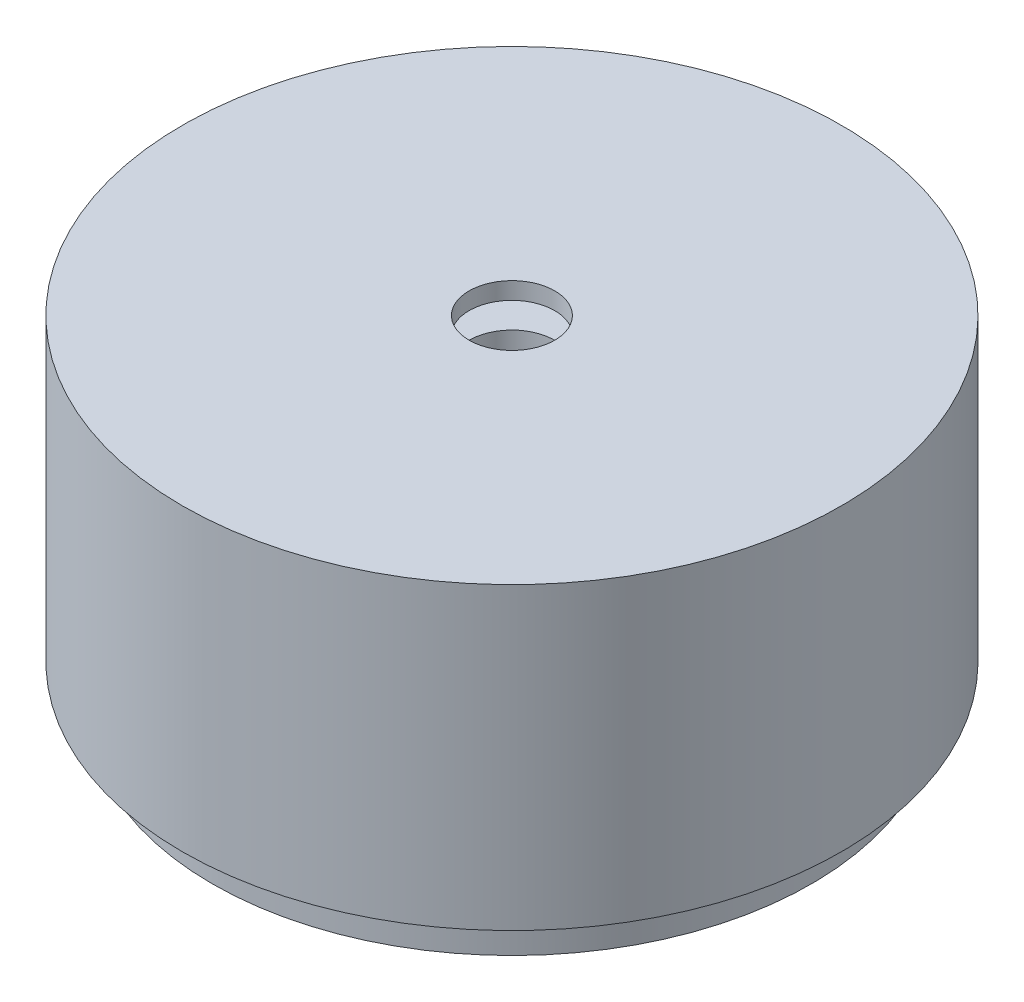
from build123d import *

# Parameters (mm, degrees)
SKIZZE1_R                            = 35
AUFSATZ_LINEAR_AUSTRAGEN1_DEPTH      = 35
AUFSATZ_LINEAR_AUSTRAGEN2_DEPTH      = 3
AUFSATZ_LINEAR_AUSTRAGEN2_DEPTH_BACK = 30
SKIZZE2_R                            = 38.5
SKIZZE2_R_2                          = 36.5
SKIZZE7_R                            = 38.5
AUFSATZ_LINEAR_AUSTRAGEN4_DEPTH      = 2
SKIZZE8_R                            = 5
SCHNITT_LINEAR_AUSTRAGEN2_DEPTH      = 68.561083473


with BuildPart() as part:
    # Skizze1 → Aufsatz-Linear austragen1 (new body)
    with BuildSketch(Plane(origin=(0, 0, 0), x_dir=(1, 0, 0), z_dir=(0, 1, 0))):
        with Locations(Location((0, 0, 0), (0, 0, 270))):
            Circle(SKIZZE1_R)
    extrude(amount=AUFSATZ_LINEAR_AUSTRAGEN1_DEPTH)


with BuildPart() as body_2:
    # Skizze2 → Aufsatz-Linear austragen2 (new, two sides: drawn at the far end of the back side and taken through both)
    with BuildSketch(Plane(origin=(0, 35, 0), x_dir=(1, 0, 0), z_dir=(0, 1, 0)).offset(-AUFSATZ_LINEAR_AUSTRAGEN2_DEPTH_BACK)):
        with Locations(Location((0, 0, 0), (0, 0, 270))):
            Circle(SKIZZE2_R)
        with Locations(Location((0, 0, 0), (0, 0, 270))):
            Circle(SKIZZE2_R_2, mode=Mode.SUBTRACT)
    extrude(amount=AUFSATZ_LINEAR_AUSTRAGEN2_DEPTH + AUFSATZ_LINEAR_AUSTRAGEN2_DEPTH_BACK)

    # Skizze7 → Aufsatz-Linear austragen4 (add)
    with BuildSketch(Plane(origin=(0, 38, 0), x_dir=(1, 0, 0), z_dir=(0, 1, 0))):
        with Locations(Location((0, 0, 0), (0, 0, 270))):
            Circle(SKIZZE7_R)
    extrude(amount=AUFSATZ_LINEAR_AUSTRAGEN4_DEPTH)


with BuildPart() as schnitt_linear_austragen2_tool:
    # Skizze8 → Schnitt-Linear austragen2 (new, through all)
    with BuildSketch(Plane(origin=(0, 40, 0), x_dir=(1, 0, 0), z_dir=(0, 1, 0))):
        with Locations(Location((0, 0, 0), (0, 0, 270))):
            Circle(SKIZZE8_R)
    extrude(amount=-SCHNITT_LINEAR_AUSTRAGEN2_DEPTH)


with BuildPart() as part_1:
    add(part.part)

    # Schnitt-Linear austragen2: cut by schnitt_linear_austragen2_tool
    add(schnitt_linear_austragen2_tool.part, mode=Mode.SUBTRACT)


with BuildPart() as body_2_1:
    add(body_2.part)

    # Schnitt-Linear austragen2: cut by schnitt_linear_austragen2_tool
    add(schnitt_linear_austragen2_tool.part, mode=Mode.SUBTRACT)


solid = Compound([part_1.part, body_2_1.part])
